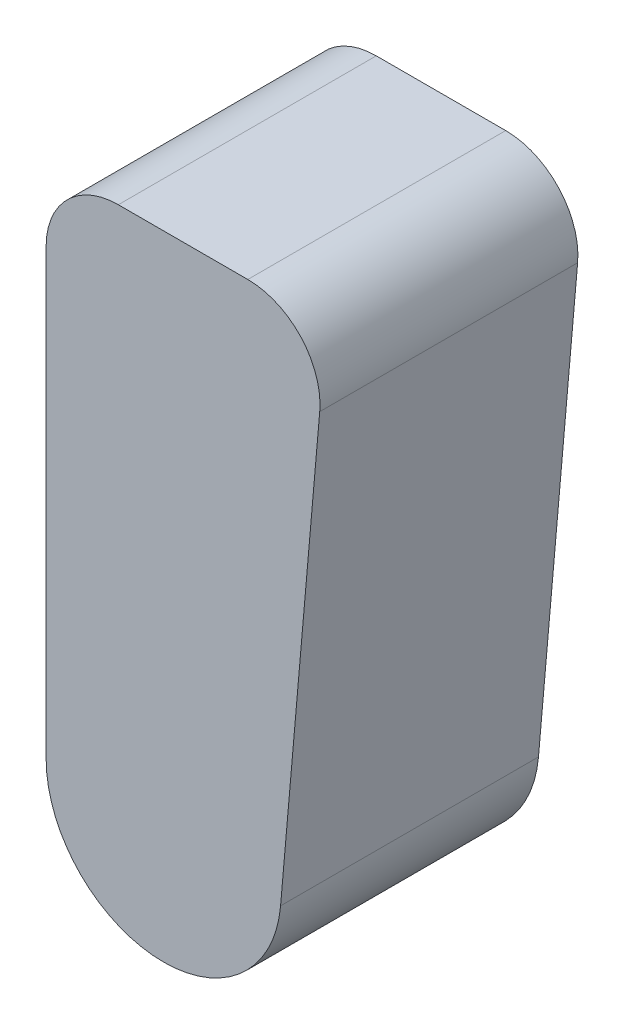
from build123d import *

# Parameters (mm, degrees)
BOSS_EXTRU_1_DEPTH = 25
CONG_1_R           = 7


with BuildPart() as part:
    # Esquisse2 → Boss.-Extru.1 (new body)
    with BuildSketch(Plane.XY):
        with BuildLine():
            Line((-11.384647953, 50), (15.802568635, 50))
            Line((15.802568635, 50), (11.341325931, -0.992237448))
            ThreePointArc((11.341325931, -0.992237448), (-0.496591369, -11.373812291), (-11.384647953, 0))
            Line((-11.384647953, 0), (-11.384647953, 50))
        make_face()
    extrude(amount=BOSS_EXTRU_1_DEPTH)

    # Cong_1
    cong_1_edges = [part.edges().sort_by_distance(p)[0] for p in [
        (-11.384647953, 50, 12.5),
        (15.802568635, 50, 12.5),
    ]]
    fillet(cong_1_edges, radius=CONG_1_R)


solid = part.part
